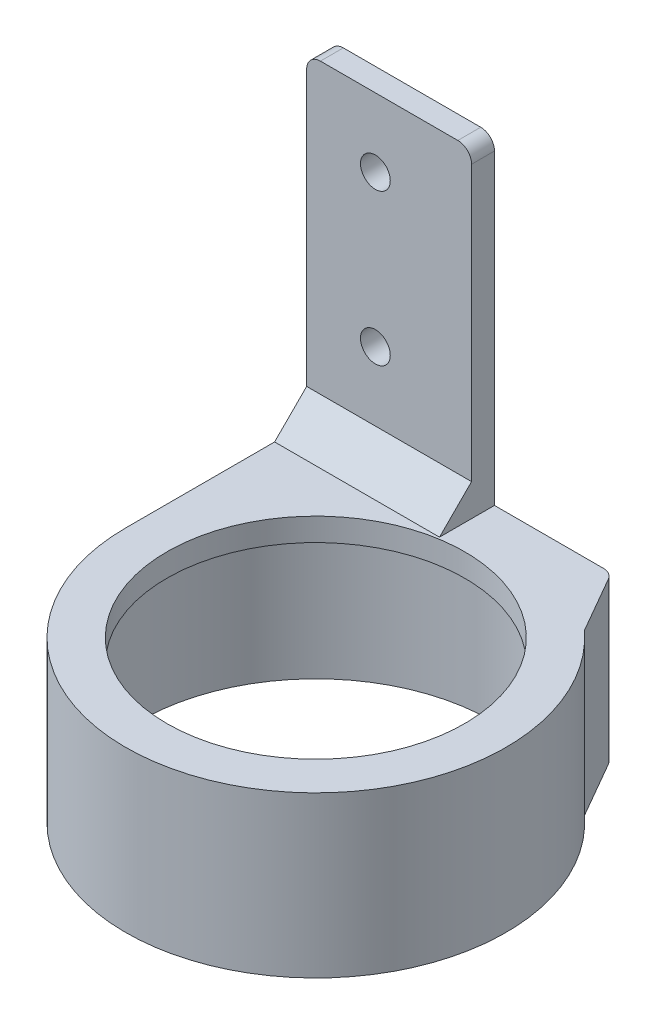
from build123d import *

# Parameters (mm, degrees)
SKIZZE1_R                       = 3.25
AUFSATZ_LINEAR_AUSTRAGEN1_DEPTH = 3
SKIZZE4_R                       = 41.5
AUFSATZ_LINEAR_AUSTRAGEN2_DEPTH = 35
SKIZZE6_R                       = 38.5
SCHNITT_LINEAR_AUSTRAGEN1_DEPTH = 160.091168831
SKIZZE7_R                       = 38.5
SKIZZE7_R_2                     = 32.5
LINEAR_AUSTRAGEN_D_NN1_DEPTH    = 5
SKIZZE16_W                      = 25.5
SKIZZE16_H                      = 35
AUFSATZ_LINEAR_AUSTRAGEN3_DEPTH = 3
AUFSATZ_LINEAR_AUSTRAGEN4_DEPTH = 35
AUFSATZ_LINEAR_AUSTRAGEN5_DEPTH = 35
SCHNITT_LINEAR_AUSTRAGEN3_DEPTH = 139.509927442
SKIZZE29_R                      = 3.25
AUFSATZ_LINEAR_AUSTRAGEN8_DEPTH = 2
AUFSATZ_LINEAR_AUSTRAGEN6_DEPTH = 36


with BuildPart() as part:
    # Skizze1 → Aufsatz-Linear austragen1 (new body)
    with BuildSketch(Plane.XY):
        with BuildLine():
            Line((3, 0), (33, 0))
            ThreePointArc((33, 0), (35.121320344, -0.878679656), (36, -3))
            Line((36, -3), (36, -97))
            Line((36, -97), (36, -105))
            Line((36, -105), (33, -105))
            Line((33, -105), (3, -105))
            Line((3, -105), (0, -105))
            Line((0, -105), (0, -97))
            Line((0, -97), (0, -3))
            ThreePointArc((0, -3), (0.878679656, -0.878679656), (3, 0))
        make_face()
        with Locations((15, -15)):
            Circle(SKIZZE1_R, mode=Mode.SUBTRACT)
        with Locations((15, -48)):
            Circle(SKIZZE1_R, mode=Mode.SUBTRACT)
    extrude(amount=AUFSATZ_LINEAR_AUSTRAGEN1_DEPTH)

    # Skizze16 → Aufsatz-Linear austragen3 (add)
    with BuildSketch(Plane(origin=(0, 0, 0), x_dir=(-1, 0, 0), z_dir=(0, 0, -1))):
        with Locations((-48.75, -87.5)):
            Rectangle(SKIZZE16_W, SKIZZE16_H)
    extrude(amount=-AUFSATZ_LINEAR_AUSTRAGEN3_DEPTH)



with BuildPart() as body_2:
    # Skizze4 → Aufsatz-Linear austragen2 (new body)
    with BuildSketch(Plane.XZ.offset(105)):
        with Locations(Location((41.5, 44.5, 0), (0, 0, 270))):
            Circle(SKIZZE4_R)
    extrude(amount=-AUFSATZ_LINEAR_AUSTRAGEN2_DEPTH)

    # Skizze6 → Schnitt-Linear austragen1 (cut, through all)
    with BuildSketch(Plane(origin=(0, -105, 0), x_dir=(-1, 0, 0), z_dir=(0, -1, 0))):
        with Locations(Location((-41.5, -44.5, 0), (0, 0, 90))):
            Circle(SKIZZE6_R)
    extrude(amount=-SCHNITT_LINEAR_AUSTRAGEN1_DEPTH, mode=Mode.SUBTRACT)

    # Skizze7 → Linear-Austragen-D_nn1 (add)
    with BuildSketch(Plane(origin=(0, -70, 0), x_dir=(1, 0, 0), z_dir=(0, 1, 0))):
        with Locations((41.5, -44.5)):
            Circle(SKIZZE7_R)
        with Locations((41.5, -44.5)):
            Circle(SKIZZE7_R_2, mode=Mode.SUBTRACT)
    extrude(amount=-LINEAR_AUSTRAGEN_D_NN1_DEPTH)


with BuildPart() as part_1:
    add(part.part)

    add(body_2.part)  # Aufsatz-Linear austragen4 merges body 2
    # Skizze17 → Aufsatz-Linear austragen4 (add)
    with BuildSketch(Plane.XZ.offset(105)):
        Polygon((69.453110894, 13.826337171), (65.463261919, 10.61767307), (61.157704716, 7.951065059), (56.456387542, 5.788806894), (51.630976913, 4.255580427), (46.581071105, 3.312226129), (41.5, 3), (61.5, 3), (61.5, 0), align=None)
    extrude(amount=-AUFSATZ_LINEAR_AUSTRAGEN4_DEPTH)

    # Skizze19 → Aufsatz-Linear austragen5 (add)
    with BuildSketch(Plane.XZ.offset(105)):
        Polygon((0, 44.5), (0.292769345, 39.579213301), (1.32012733, 34.115981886), (2.987465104, 29.039254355), (5.405172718, 24.020413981), (8.439906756, 19.41454137), (12.000641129, 15.310313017), (16.158896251, 11.635452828), (20.622161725, 8.634056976), (25.534528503, 6.193946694), (30.699904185, 4.429962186), (36.038410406, 3.360954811), (41.5, 3), (0, 3), align=None)
    extrude(amount=-AUFSATZ_LINEAR_AUSTRAGEN5_DEPTH)

    # Skizze21 → Schnitt-Linear austragen3 (cut, through all)
    with BuildSketch(Plane(origin=(0, -70, 0), x_dir=(1, 0, 0), z_dir=(0, 1, 0))):
        with BuildLine():
            Line((61.5, 0), (59.764741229, 0))
            ThreePointArc((59.764741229, 0), (61.266823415, -0.403127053), (62.365218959, -1.504167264))
            Line((62.365218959, -1.504167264), (61.5, 0))
        make_face()
    extrude(amount=-SCHNITT_LINEAR_AUSTRAGEN3_DEPTH, mode=Mode.SUBTRACT)

    # Skizze29 → Aufsatz-Linear austragen8 (add)
    with BuildSketch(Plane.XY.offset(3)):
        with BuildLine():
            Line((3, 0), (33, 0))
            ThreePointArc((33, 0), (35.121320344, -0.878679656), (36, -3))
            Line((36, -3), (36, -70))
            Line((36, -70), (0, -70))
            Line((0, -70), (0, -3))
            ThreePointArc((0, -3), (0.878679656, -0.878679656), (3, 0))
        make_face()
        with Locations((15, -15)):
            Circle(SKIZZE29_R, mode=Mode.SUBTRACT)
        with Locations((15, -48)):
            Circle(SKIZZE29_R, mode=Mode.SUBTRACT)
    extrude(amount=AUFSATZ_LINEAR_AUSTRAGEN8_DEPTH)

    # Skizze26 → Aufsatz-Linear austragen6 (add)
    with BuildSketch(Plane.ZY):
        Polygon((5, -70), (5, -63), (12, -70), align=None)
    extrude(amount=-AUFSATZ_LINEAR_AUSTRAGEN6_DEPTH)


solid = part_1.part
